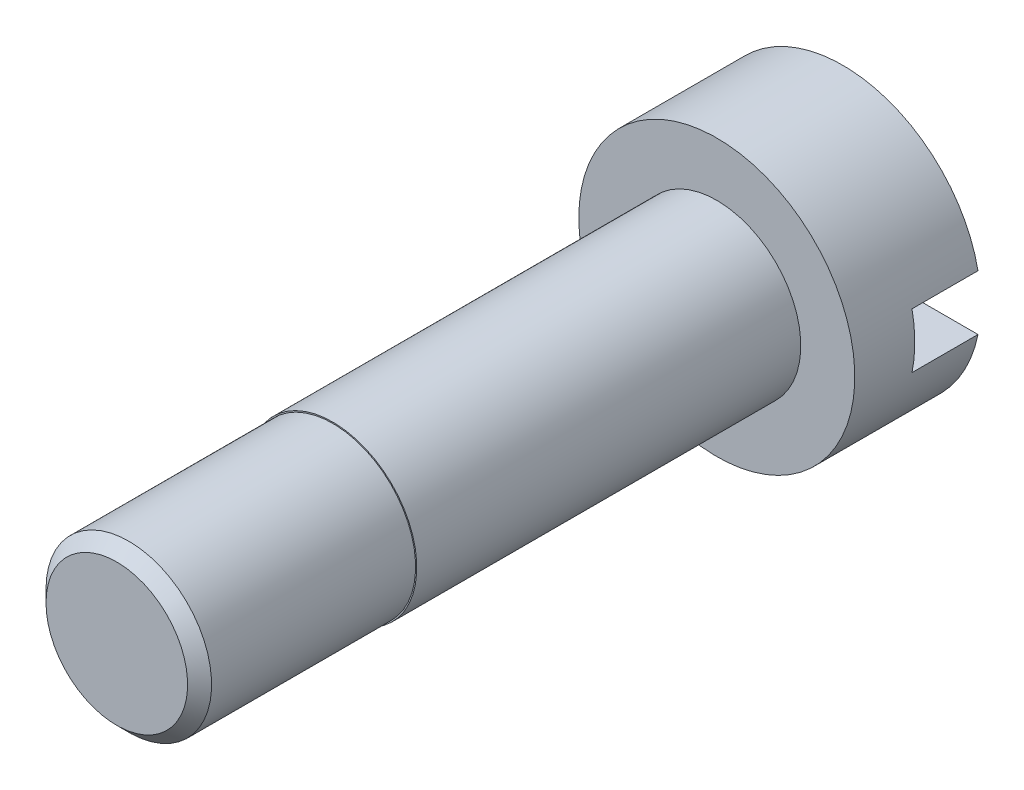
from build123d import *

# Parameters (mm, degrees)
SKETCH_2_W          = 1.397
SKETCH_2_H          = 1.1684
CUT_EXTRUDE_1_DEPTH = 3.81


with BuildPart() as part:
    # Sketch 1 → Revolve 1 (revolve)
    with BuildSketch(Plane(origin=(0, 0, 0), x_dir=(0, 0, -1), z_dir=(1, 0, 0)), mode=Mode.PRIVATE) as revolve_1_sk:
        Polygon((0, 0), (0, 2.921), (-2.667, 2.921), (-2.667, 1.778), (-10.795, 1.778), (-10.795, 1.7526), (-15.113, 1.7526), (-15.367, 1.4986), (-15.367, 0), align=None)
    revolve(revolve_1_sk.sketch.rotate(Axis((0, 0, 0), (0, 0, 1)), 90), axis=Axis((0, 0, 0), (0, 0, 1)))

    # Sketch 2 → Cut-Extrude 1 (cut, symmetric)
    with BuildSketch(Plane(origin=(0, 0, 0), x_dir=(0, 0, -1), z_dir=(1, 0, 0))):
        with Locations((-0.6985, 0)):
            Rectangle(SKETCH_2_W, SKETCH_2_H)
    extrude(amount=CUT_EXTRUDE_1_DEPTH, both=True, mode=Mode.SUBTRACT)


solid = part.part
